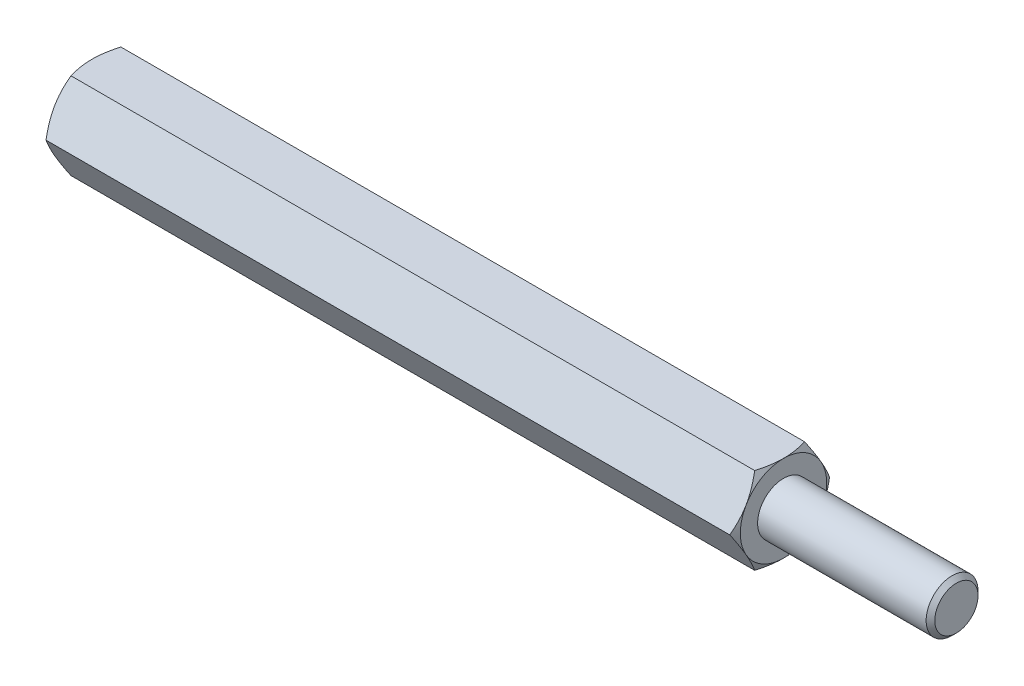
ISO-10303-21;
HEADER;
FILE_DESCRIPTION(('STEP AP214'),'2;1');
FILE_NAME('part.step','',(''),(''),'','','');
FILE_SCHEMA(('AUTOMOTIVE_DESIGN { 1 0 10303 214 1 1 1 1 }'));
ENDSEC;
DATA;
#1=APPLICATION_CONTEXT('core data for automotive mechanical design processes');
#2=APPLICATION_PROTOCOL_DEFINITION('international standard','automotive_design',2000,#1);
#3=PRODUCT_CONTEXT('',#1,'mechanical');
#4=PRODUCT('Part','Part','',(#3));
#5=PRODUCT_RELATED_PRODUCT_CATEGORY('part','',(#4));
#6=PRODUCT_DEFINITION_FORMATION('','',#4);
#7=PRODUCT_DEFINITION_CONTEXT('part definition',#1,'design');
#8=PRODUCT_DEFINITION('design','',#6,#7);
#9=PRODUCT_DEFINITION_SHAPE('','',#8);
#10=(LENGTH_UNIT() NAMED_UNIT(*) SI_UNIT(.MILLI.,.METRE.));
#11=(NAMED_UNIT(*) PLANE_ANGLE_UNIT() SI_UNIT($,.RADIAN.));
#12=(NAMED_UNIT(*) SI_UNIT($,.STERADIAN.) SOLID_ANGLE_UNIT());
#13=UNCERTAINTY_MEASURE_WITH_UNIT(LENGTH_MEASURE(1.E-05),#10,'distance_accuracy_value','');
#14=(GEOMETRIC_REPRESENTATION_CONTEXT(3) GLOBAL_UNCERTAINTY_ASSIGNED_CONTEXT((#13)) GLOBAL_UNIT_ASSIGNED_CONTEXT((#10,
#11,#12)) REPRESENTATION_CONTEXT('',''));
#15=CARTESIAN_POINT('',(0.,0.,0.));
#16=DIRECTION('',(0.,0.,1.));
#17=DIRECTION('',(1.,0.,0.));
#18=AXIS2_PLACEMENT_3D('',#15,#16,#17);
#19=CARTESIAN_POINT('',(20.,2.5,-1.44337567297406));
#20=DIRECTION('',(1.,0.,0.));
#21=DIRECTION('',(0.,0.,-1.));
#22=AXIS2_PLACEMENT_3D('',#19,#20,#21);
#23=PLANE('',#22);
#24=CARTESIAN_POINT('',(20.,0.,0.));
#25=DIRECTION('',(1.,0.,0.));
#26=DIRECTION('',(0.,0.,-1.));
#27=AXIS2_PLACEMENT_3D('',#24,#25,#26);
#28=CIRCLE('',#27,2.5);
#29=CARTESIAN_POINT('',(20.,-1.25,-2.1650635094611));
#30=VERTEX_POINT('',#29);
#31=CARTESIAN_POINT('',(20.,1.25,-2.1650635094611));
#32=VERTEX_POINT('',#31);
#33=EDGE_CURVE('E288',#30,#32,#28,.T.);
#34=ORIENTED_EDGE('',*,*,#33,.T.);
#35=CARTESIAN_POINT('',(20.,2.5,0.));
#36=VERTEX_POINT('',#35);
#37=EDGE_CURVE('E53',#32,#36,#28,.T.);
#38=ORIENTED_EDGE('',*,*,#37,.T.);
#39=CARTESIAN_POINT('',(20.,1.25,2.1650635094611));
#40=VERTEX_POINT('',#39);
#41=EDGE_CURVE('E297',#36,#40,#28,.T.);
#42=ORIENTED_EDGE('',*,*,#41,.T.);
#43=CARTESIAN_POINT('',(20.,-1.25000000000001,2.1650635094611));
#44=VERTEX_POINT('',#43);
#45=EDGE_CURVE('E301',#40,#44,#28,.T.);
#46=ORIENTED_EDGE('',*,*,#45,.T.);
#47=CARTESIAN_POINT('',(20.,0.,0.));
#48=DIRECTION('',(-1.,0.,0.));
#49=DIRECTION('',(0.,-1.,0.));
#50=AXIS2_PLACEMENT_3D('',#47,#48,#49);
#51=CIRCLE('',#50,2.5);
#52=CARTESIAN_POINT('',(20.,-2.50000000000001,0.));
#53=VERTEX_POINT('',#52);
#54=EDGE_CURVE('E193',#53,#44,#51,.T.);
#55=ORIENTED_EDGE('',*,*,#54,.F.);
#56=EDGE_CURVE('E61',#53,#30,#28,.T.);
#57=ORIENTED_EDGE('',*,*,#56,.T.);
#58=EDGE_LOOP('',(#34,#38,#42,#46,#55,#57));
#59=FACE_BOUND('',#58,.T.);
#60=CARTESIAN_POINT('',(20.,0.,0.));
#61=DIRECTION('',(1.,0.,0.));
#62=DIRECTION('',(0.,0.,-1.));
#63=AXIS2_PLACEMENT_3D('',#60,#61,#62);
#64=CIRCLE('',#63,1.5);
#65=CARTESIAN_POINT('',(20.,0.,-1.5));
#66=VERTEX_POINT('',#65);
#67=EDGE_CURVE('E409',#66,#66,#64,.T.);
#68=ORIENTED_EDGE('',*,*,#67,.F.);
#69=EDGE_LOOP('',(#68));
#70=FACE_BOUND('',#69,.T.);
#71=ADVANCED_FACE('F37',(#59,#70),#23,.T.);
#72=CARTESIAN_POINT('',(20.,0.,-2.88675134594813));
#73=DIRECTION('',(0.,-0.5,0.866025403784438));
#74=DIRECTION('',(0.,-0.866025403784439,-0.5));
#75=AXIS2_PLACEMENT_3D('',#72,#73,#74);
#76=PLANE('',#75);
#77=CARTESIAN_POINT('',(19.7766423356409,-0.000200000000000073,-2.88686681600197));
#78=CARTESIAN_POINT('',(19.8132783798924,0.109663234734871,-2.82343724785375));
#79=CARTESIAN_POINT('',(19.8465977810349,0.220474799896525,-2.75946016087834));
#80=CARTESIAN_POINT('',(19.9047577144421,0.444016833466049,-2.63039810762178));
#81=CARTESIAN_POINT('',(19.9295776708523,0.556751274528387,-2.5653108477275));
#82=CARTESIAN_POINT('',(19.968214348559,0.780822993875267,-2.43594298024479));
#83=CARTESIAN_POINT('',(19.9822882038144,0.892125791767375,-2.37168227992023));
#84=CARTESIAN_POINT('',(19.9990908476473,1.11525522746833,-2.24285844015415));
#85=CARTESIAN_POINT('',(20.0018335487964,1.22708105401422,-2.17829576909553));
#86=CARTESIAN_POINT('',(19.9961342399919,1.43604197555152,-2.05765212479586));
#87=CARTESIAN_POINT('',(19.9890916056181,1.53320831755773,-2.0015531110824));
#88=CARTESIAN_POINT('',(19.9667685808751,1.726907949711,-1.88972057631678));
#89=CARTESIAN_POINT('',(19.9514805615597,1.82344056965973,-1.8339874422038));
#90=CARTESIAN_POINT('',(19.9132609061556,2.01753972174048,-1.7219242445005));
#91=CARTESIAN_POINT('',(19.8901672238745,2.11508168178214,-1.66560836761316));
#92=CARTESIAN_POINT('',(19.8377533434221,2.30871060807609,-1.55381665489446));
#93=CARTESIAN_POINT('',(19.8084454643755,2.40480005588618,-1.49833938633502));
#94=CARTESIAN_POINT('',(19.7766423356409,2.5002,-1.44326020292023));
#95=B_SPLINE_CURVE_WITH_KNOTS('',3,(#77,#78,#79,#80,#81,#82,#83,#84,#85,#86,#87,#88,#89,#90,#91,
#92,#93,#94),.UNSPECIFIED.,.F.,.F.,(4,2,2,2,2,2,2,2,4),(0.,0.396285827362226,0.793524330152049,
1.18093086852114,1.56786160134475,1.90479741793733,2.24204551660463,2.58677531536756,
2.93082800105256),.UNSPECIFIED.);
#96=CARTESIAN_POINT('',(19.7767090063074,0.,-2.88675134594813));
#97=VERTEX_POINT('',#96);
#98=EDGE_CURVE('E312',#97,#32,#95,.T.);
#99=ORIENTED_EDGE('',*,*,#98,.F.);
#100=DIRECTION('',(-1.,0.,0.));
#101=VECTOR('',#100,1.);
#102=CARTESIAN_POINT('',(20.,0.,-2.88675134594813));
#103=LINE('',#102,#101);
#104=CARTESIAN_POINT('',(-19.7767090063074,0.,-2.88675134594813));
#105=VERTEX_POINT('',#104);
#106=EDGE_CURVE('E264',#97,#105,#103,.T.);
#107=ORIENTED_EDGE('',*,*,#106,.T.);
#108=CARTESIAN_POINT('',(-19.7766423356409,2.5002,-1.44326020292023));
#109=CARTESIAN_POINT('',(-19.8132783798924,2.39033676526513,-1.50668977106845));
#110=CARTESIAN_POINT('',(-19.8465977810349,2.27952520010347,-1.57066685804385));
#111=CARTESIAN_POINT('',(-19.9047577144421,2.05598316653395,-1.69972891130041));
#112=CARTESIAN_POINT('',(-19.9295776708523,1.94324872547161,-1.7648161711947));
#113=CARTESIAN_POINT('',(-19.968214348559,1.71917700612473,-1.8941840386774));
#114=CARTESIAN_POINT('',(-19.9822882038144,1.60787420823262,-1.95844473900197));
#115=CARTESIAN_POINT('',(-19.9990908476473,1.38474477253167,-2.08726857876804));
#116=CARTESIAN_POINT('',(-20.0018335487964,1.27291894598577,-2.15183124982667));
#117=CARTESIAN_POINT('',(-19.9961342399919,1.06395802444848,-2.27247489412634));
#118=CARTESIAN_POINT('',(-19.9890916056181,0.96679168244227,-2.32857390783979));
#119=CARTESIAN_POINT('',(-19.9667685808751,0.773092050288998,-2.44040644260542));
#120=CARTESIAN_POINT('',(-19.9514805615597,0.676559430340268,-2.49613957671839));
#121=CARTESIAN_POINT('',(-19.9132609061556,0.482460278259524,-2.60820277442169));
#122=CARTESIAN_POINT('',(-19.8901672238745,0.38491831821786,-2.66451865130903));
#123=CARTESIAN_POINT('',(-19.8377533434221,0.191289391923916,-2.77631036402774));
#124=CARTESIAN_POINT('',(-19.8084454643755,0.0951999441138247,-2.83178763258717));
#125=CARTESIAN_POINT('',(-19.7766423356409,-0.000199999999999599,-2.88686681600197));
#126=B_SPLINE_CURVE_WITH_KNOTS('',3,(#108,#109,#110,#111,#112,#113,#114,#115,#116,#117,#118,
#119,#120,#121,#122,#123,#124,#125),.UNSPECIFIED.,.F.,.F.,(4,2,2,2,2,2,2,2,4),(0.,
0.396285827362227,0.79352433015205,1.18093086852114,1.56786160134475,1.90479741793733,
2.24204551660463,2.58677531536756,2.93082800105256),.UNSPECIFIED.);
#127=CARTESIAN_POINT('',(-20.,1.25,-2.1650635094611));
#128=VERTEX_POINT('',#127);
#129=EDGE_CURVE('E378',#128,#105,#126,.T.);
#130=ORIENTED_EDGE('',*,*,#129,.F.);
#131=CARTESIAN_POINT('',(-19.7767090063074,2.5,-1.44337567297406));
#132=VERTEX_POINT('',#131);
#133=EDGE_CURVE('E376',#132,#128,#126,.T.);
#134=ORIENTED_EDGE('',*,*,#133,.F.);
#135=DIRECTION('',(-1.,0.,0.));
#136=VECTOR('',#135,1.);
#137=CARTESIAN_POINT('',(20.,2.5,-1.44337567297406));
#138=LINE('',#137,#136);
#139=CARTESIAN_POINT('',(19.7767090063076,2.5,-1.44337567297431));
#140=VERTEX_POINT('',#139);
#141=EDGE_CURVE('E279',#140,#132,#138,.T.);
#142=ORIENTED_EDGE('',*,*,#141,.F.);
#143=EDGE_CURVE('E229',#32,#140,#95,.T.);
#144=ORIENTED_EDGE('',*,*,#143,.F.);
#145=EDGE_LOOP('',(#99,#107,#130,#134,#142,#144));
#146=FACE_BOUND('',#145,.T.);
#147=ADVANCED_FACE('F148',(#146),#76,.F.);
#148=CARTESIAN_POINT('',(20.,2.5,-1.44337567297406));
#149=DIRECTION('',(0.,-1.,0.));
#150=DIRECTION('',(0.,0.,-1.));
#151=AXIS2_PLACEMENT_3D('',#148,#149,#150);
#152=PLANE('',#151);
#153=CARTESIAN_POINT('',(18.7680338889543,2.5,-3.90158441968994));
#154=CARTESIAN_POINT('',(18.8212077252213,2.5,-3.79217004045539));
#155=CARTESIAN_POINT('',(18.8738786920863,2.5,-3.68250707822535));
#156=CARTESIAN_POINT('',(18.9779324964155,2.5,-3.46255185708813));
#157=CARTESIAN_POINT('',(19.0293151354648,2.5,-3.35225950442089));
#158=CARTESIAN_POINT('',(19.1307630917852,2.5,-3.13035696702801));
#159=CARTESIAN_POINT('',(19.1808199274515,2.5,-3.0187428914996));
#160=CARTESIAN_POINT('',(19.2789171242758,2.5,-2.79463535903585));
#161=CARTESIAN_POINT('',(19.3269575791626,2.5,-2.68214194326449));
#162=CARTESIAN_POINT('',(19.4220184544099,2.5,-2.45240385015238));
#163=CARTESIAN_POINT('',(19.4689543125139,2.5,-2.33512399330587));
#164=CARTESIAN_POINT('',(19.5593326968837,2.5,-2.09920133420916));
#165=CARTESIAN_POINT('',(19.6027748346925,2.5,-1.98055838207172));
#166=CARTESIAN_POINT('',(19.6850435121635,2.5,-1.74193489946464));
#167=CARTESIAN_POINT('',(19.7238791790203,2.5,-1.6219575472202));
#168=CARTESIAN_POINT('',(19.7957050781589,2.5,-1.38028205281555));
#169=CARTESIAN_POINT('',(19.8286971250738,2.5,-1.25858445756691));
#170=CARTESIAN_POINT('',(19.8870959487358,2.5,-1.01406369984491));
#171=CARTESIAN_POINT('',(19.9125437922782,2.5,-0.891250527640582));
#172=CARTESIAN_POINT('',(19.9544275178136,2.5,-0.644071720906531));
#173=CARTESIAN_POINT('',(19.9708643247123,2.5,-0.519706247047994));
#174=CARTESIAN_POINT('',(19.9932006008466,2.5,-0.271679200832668));
#175=CARTESIAN_POINT('',(19.9992375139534,2.5,-0.148030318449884));
#176=CARTESIAN_POINT('',(20.0006256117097,2.5,0.0993395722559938));
#177=CARTESIAN_POINT('',(19.9959765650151,2.5,0.223060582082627));
#178=CARTESIAN_POINT('',(19.9794044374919,2.5,0.432351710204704));
#179=CARTESIAN_POINT('',(19.9701066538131,2.5,0.518143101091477));
#180=CARTESIAN_POINT('',(19.9469384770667,2.5,0.689112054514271));
#181=CARTESIAN_POINT('',(19.9330674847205,2.5,0.774289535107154));
#182=CARTESIAN_POINT('',(19.8853202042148,2.5,1.02876599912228));
#183=CARTESIAN_POINT('',(19.8453176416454,2.5,1.19691958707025));
#184=CARTESIAN_POINT('',(19.7522656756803,2.5,1.53362893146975));
#185=CARTESIAN_POINT('',(19.6989362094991,2.5,1.70210423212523));
#186=CARTESIAN_POINT('',(19.6123716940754,2.5,1.95247339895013));
#187=CARTESIAN_POINT('',(19.5824247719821,2.5,2.0355318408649));
#188=CARTESIAN_POINT('',(19.5206840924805,2.5,2.20095860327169));
#189=CARTESIAN_POINT('',(19.4888903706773,2.5,2.28332693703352));
#190=CARTESIAN_POINT('',(19.404014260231,2.5,2.49723312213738));
#191=CARTESIAN_POINT('',(19.3497173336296,2.5,2.62828796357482));
#192=CARTESIAN_POINT('',(19.2381273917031,2.5,2.88912034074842));
#193=CARTESIAN_POINT('',(19.1808341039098,2.5,3.01889775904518));
#194=CARTESIAN_POINT('',(19.0639348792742,2.5,3.27745045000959));
#195=CARTESIAN_POINT('',(19.004328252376,2.5,3.40622540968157));
#196=CARTESIAN_POINT('',(18.8833234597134,2.5,3.66293235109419));
#197=CARTESIAN_POINT('',(18.821925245,2.5,3.7908643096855));
#198=CARTESIAN_POINT('',(18.6354580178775,2.5,4.17399495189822));
#199=CARTESIAN_POINT('',(18.5082824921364,2.5,4.42816724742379));
#200=CARTESIAN_POINT('',(18.2503455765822,2.5,4.9346146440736));
#201=CARTESIAN_POINT('',(18.1195848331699,2.5,5.1868900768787));
#202=CARTESIAN_POINT('',(17.8687100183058,2.5,5.66512451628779));
#203=CARTESIAN_POINT('',(17.7488298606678,2.5,5.89120644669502));
#204=CARTESIAN_POINT('',(17.5075902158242,2.5,6.34259369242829));
#205=CARTESIAN_POINT('',(17.3862306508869,2.5,6.56789896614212));
#206=CARTESIAN_POINT('',(17.142780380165,2.5,7.01722044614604));
#207=CARTESIAN_POINT('',(17.0206930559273,2.5,7.24123848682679));
#208=CARTESIAN_POINT('',(16.7756662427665,2.5,7.68878772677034));
#209=CARTESIAN_POINT('',(16.652726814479,2.5,7.91231895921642));
#210=CARTESIAN_POINT('',(16.5294756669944,2.5,8.1356769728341));
#211=B_SPLINE_CURVE_WITH_KNOTS('',3,(#153,#154,#155,#156,#157,#158,#159,#160,#161,#162,#163,
#164,#165,#166,#167,#168,#169,#170,#171,#172,#173,#174,#175,#176,#177,#178,#179,#180,#181,#182,
#183,#184,#185,#186,#187,#188,#189,#190,#191,#192,#193,#194,#195,#196,#197,#198,#199,#200,#201,
#202,#203,#204,#205,#206,#207,#208,#209,#210),.UNSPECIFIED.,.F.,.F.,(4,2,2,2,2,2,2,2,2,2,2,2,2,
2,2,2,2,2,2,2,2,2,2,2,2,2,2,2,4),(0.,0.364957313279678,0.729970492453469,1.09692930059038,
1.46387103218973,1.84279746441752,2.22176597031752,2.59997058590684,2.97805755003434,
3.35404692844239,3.72999770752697,4.10094071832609,4.47189175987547,4.73064905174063,
4.98944026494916,5.50729076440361,6.03710483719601,6.30196454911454,6.56681915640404,
6.99233818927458,7.41789598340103,7.84358170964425,8.26927907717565,9.12186602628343,
9.97430025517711,10.7419897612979,11.5097197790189,12.2750964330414,13.0404191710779),.UNSPECIFIED.);
#212=EDGE_CURVE('E227',#140,#36,#211,.T.);
#213=ORIENTED_EDGE('',*,*,#212,.F.);
#214=ORIENTED_EDGE('',*,*,#141,.T.);
#215=CARTESIAN_POINT('',(-18.7680338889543,2.5,-3.90158441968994));
#216=CARTESIAN_POINT('',(-18.8212077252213,2.5,-3.79217004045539));
#217=CARTESIAN_POINT('',(-18.8738786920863,2.5,-3.68250707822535));
#218=CARTESIAN_POINT('',(-18.9779324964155,2.5,-3.46255185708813));
#219=CARTESIAN_POINT('',(-19.0293151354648,2.5,-3.35225950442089));
#220=CARTESIAN_POINT('',(-19.1307630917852,2.5,-3.13035696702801));
#221=CARTESIAN_POINT('',(-19.1808199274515,2.5,-3.0187428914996));
#222=CARTESIAN_POINT('',(-19.2789171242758,2.5,-2.79463535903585));
#223=CARTESIAN_POINT('',(-19.3269575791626,2.5,-2.68214194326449));
#224=CARTESIAN_POINT('',(-19.4220184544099,2.5,-2.45240385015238));
#225=CARTESIAN_POINT('',(-19.4689543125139,2.5,-2.33512399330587));
#226=CARTESIAN_POINT('',(-19.5593326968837,2.5,-2.09920133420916));
#227=CARTESIAN_POINT('',(-19.6027748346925,2.5,-1.98055838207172));
#228=CARTESIAN_POINT('',(-19.6850435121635,2.5,-1.74193489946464));
#229=CARTESIAN_POINT('',(-19.7238791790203,2.5,-1.6219575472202));
#230=CARTESIAN_POINT('',(-19.7957050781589,2.5,-1.38028205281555));
#231=CARTESIAN_POINT('',(-19.8286971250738,2.5,-1.25858445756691));
#232=CARTESIAN_POINT('',(-19.8870959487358,2.5,-1.01406369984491));
#233=CARTESIAN_POINT('',(-19.9125437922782,2.5,-0.891250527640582));
#234=CARTESIAN_POINT('',(-19.9544275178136,2.5,-0.644071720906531));
#235=CARTESIAN_POINT('',(-19.9708643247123,2.5,-0.519706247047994));
#236=CARTESIAN_POINT('',(-19.9932006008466,2.5,-0.271679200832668));
#237=CARTESIAN_POINT('',(-19.9992375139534,2.5,-0.148030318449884));
#238=CARTESIAN_POINT('',(-20.0006256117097,2.5,0.0993395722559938));
#239=CARTESIAN_POINT('',(-19.9959765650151,2.5,0.223060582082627));
#240=CARTESIAN_POINT('',(-19.9794044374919,2.5,0.432351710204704));
#241=CARTESIAN_POINT('',(-19.9701066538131,2.5,0.518143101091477));
#242=CARTESIAN_POINT('',(-19.9469384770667,2.5,0.689112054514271));
#243=CARTESIAN_POINT('',(-19.9330674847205,2.5,0.774289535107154));
#244=CARTESIAN_POINT('',(-19.8853202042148,2.5,1.02876599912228));
#245=CARTESIAN_POINT('',(-19.8453176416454,2.5,1.19691958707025));
#246=CARTESIAN_POINT('',(-19.7522656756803,2.5,1.53362893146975));
#247=CARTESIAN_POINT('',(-19.6989362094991,2.5,1.70210423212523));
#248=CARTESIAN_POINT('',(-19.6123716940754,2.5,1.95247339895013));
#249=CARTESIAN_POINT('',(-19.5824247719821,2.5,2.0355318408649));
#250=CARTESIAN_POINT('',(-19.5206840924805,2.5,2.20095860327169));
#251=CARTESIAN_POINT('',(-19.4888903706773,2.5,2.28332693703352));
#252=CARTESIAN_POINT('',(-19.404014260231,2.5,2.49723312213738));
#253=CARTESIAN_POINT('',(-19.3497173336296,2.5,2.62828796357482));
#254=CARTESIAN_POINT('',(-19.2381273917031,2.5,2.88912034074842));
#255=CARTESIAN_POINT('',(-19.1808341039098,2.5,3.01889775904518));
#256=CARTESIAN_POINT('',(-19.0639348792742,2.5,3.27745045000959));
#257=CARTESIAN_POINT('',(-19.004328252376,2.5,3.40622540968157));
#258=CARTESIAN_POINT('',(-18.8833234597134,2.5,3.66293235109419));
#259=CARTESIAN_POINT('',(-18.821925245,2.5,3.7908643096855));
#260=CARTESIAN_POINT('',(-18.6354580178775,2.5,4.17399495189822));
#261=CARTESIAN_POINT('',(-18.5082824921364,2.5,4.42816724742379));
#262=CARTESIAN_POINT('',(-18.2503455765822,2.5,4.9346146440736));
#263=CARTESIAN_POINT('',(-18.1195848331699,2.5,5.1868900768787));
#264=CARTESIAN_POINT('',(-17.8687100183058,2.5,5.66512451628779));
#265=CARTESIAN_POINT('',(-17.7488298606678,2.5,5.89120644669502));
#266=CARTESIAN_POINT('',(-17.5075902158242,2.5,6.34259369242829));
#267=CARTESIAN_POINT('',(-17.3862306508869,2.5,6.56789896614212));
#268=CARTESIAN_POINT('',(-17.142780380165,2.5,7.01722044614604));
#269=CARTESIAN_POINT('',(-17.0206930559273,2.5,7.24123848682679));
#270=CARTESIAN_POINT('',(-16.7756662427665,2.5,7.68878772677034));
#271=CARTESIAN_POINT('',(-16.652726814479,2.5,7.91231895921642));
#272=CARTESIAN_POINT('',(-16.5294756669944,2.5,8.1356769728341));
#273=B_SPLINE_CURVE_WITH_KNOTS('',3,(#215,#216,#217,#218,#219,#220,#221,#222,#223,#224,#225,
#226,#227,#228,#229,#230,#231,#232,#233,#234,#235,#236,#237,#238,#239,#240,#241,#242,#243,#244,
#245,#246,#247,#248,#249,#250,#251,#252,#253,#254,#255,#256,#257,#258,#259,#260,#261,#262,#263,
#264,#265,#266,#267,#268,#269,#270,#271,#272),.UNSPECIFIED.,.F.,.F.,(4,2,2,2,2,2,2,2,2,2,2,2,2,
2,2,2,2,2,2,2,2,2,2,2,2,2,2,2,4),(0.,0.364957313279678,0.729970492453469,1.09692930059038,
1.46387103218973,1.84279746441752,2.22176597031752,2.59997058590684,2.97805755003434,
3.35404692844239,3.72999770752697,4.10094071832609,4.47189175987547,4.73064905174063,
4.98944026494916,5.50729076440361,6.03710483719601,6.30196454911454,6.56681915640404,
6.99233818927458,7.41789598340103,7.84358170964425,8.26927907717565,9.12186602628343,
9.97430025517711,10.7419897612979,11.5097197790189,12.2750964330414,13.0404191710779),.UNSPECIFIED.);
#274=CARTESIAN_POINT('',(-20.,2.5,0.));
#275=VERTEX_POINT('',#274);
#276=EDGE_CURVE('E241',#275,#132,#273,.F.);
#277=ORIENTED_EDGE('',*,*,#276,.F.);
#278=CARTESIAN_POINT('',(-19.7767090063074,2.5,1.44337567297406));
#279=VERTEX_POINT('',#278);
#280=EDGE_CURVE('E249',#279,#275,#273,.F.);
#281=ORIENTED_EDGE('',*,*,#280,.F.);
#282=DIRECTION('',(-1.,0.,0.));
#283=VECTOR('',#282,1.);
#284=CARTESIAN_POINT('',(20.,2.5,1.44337567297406));
#285=LINE('',#284,#283);
#286=CARTESIAN_POINT('',(19.7767090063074,2.5,1.44337567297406));
#287=VERTEX_POINT('',#286);
#288=EDGE_CURVE('E276',#287,#279,#285,.T.);
#289=ORIENTED_EDGE('',*,*,#288,.F.);
#290=EDGE_CURVE('E221',#36,#287,#211,.T.);
#291=ORIENTED_EDGE('',*,*,#290,.F.);
#292=EDGE_LOOP('',(#213,#214,#277,#281,#289,#291));
#293=FACE_BOUND('',#292,.T.);
#294=ADVANCED_FACE('F153',(#293),#152,.F.);
#295=CARTESIAN_POINT('',(20.,2.5,1.44337567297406));
#296=DIRECTION('',(0.,-0.5,-0.866025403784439));
#297=DIRECTION('',(0.,0.866025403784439,-0.5));
#298=AXIS2_PLACEMENT_3D('',#295,#296,#297);
#299=PLANE('',#298);
#300=CARTESIAN_POINT('',(19.7766423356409,2.5002,1.44326020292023));
#301=CARTESIAN_POINT('',(19.8132783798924,2.39033676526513,1.50668977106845));
#302=CARTESIAN_POINT('',(19.8465977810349,2.27952520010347,1.57066685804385));
#303=CARTESIAN_POINT('',(19.9047577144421,2.05598316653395,1.69972891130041));
#304=CARTESIAN_POINT('',(19.9295776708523,1.94324872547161,1.7648161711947));
#305=CARTESIAN_POINT('',(19.9682143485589,1.71917700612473,1.8941840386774));
#306=CARTESIAN_POINT('',(19.9822882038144,1.60787420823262,1.95844473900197));
#307=CARTESIAN_POINT('',(19.9990908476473,1.38474477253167,2.08726857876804));
#308=CARTESIAN_POINT('',(20.0018335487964,1.27291894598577,2.15183124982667));
#309=CARTESIAN_POINT('',(19.9961342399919,1.06395802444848,2.27247489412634));
#310=CARTESIAN_POINT('',(19.9890916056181,0.96679168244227,2.32857390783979));
#311=CARTESIAN_POINT('',(19.9667685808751,0.773092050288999,2.44040644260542));
#312=CARTESIAN_POINT('',(19.9514805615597,0.676559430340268,2.49613957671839));
#313=CARTESIAN_POINT('',(19.9132609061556,0.482460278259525,2.60820277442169));
#314=CARTESIAN_POINT('',(19.8901672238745,0.38491831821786,2.66451865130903));
#315=CARTESIAN_POINT('',(19.8377533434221,0.191289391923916,2.77631036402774));
#316=CARTESIAN_POINT('',(19.8084454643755,0.0951999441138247,2.83178763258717));
#317=CARTESIAN_POINT('',(19.7766423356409,-0.000199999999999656,2.88686681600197));
#318=B_SPLINE_CURVE_WITH_KNOTS('',3,(#300,#301,#302,#303,#304,#305,#306,#307,#308,#309,#310,
#311,#312,#313,#314,#315,#316,#317),.UNSPECIFIED.,.F.,.F.,(4,2,2,2,2,2,2,2,4),(0.,
0.396285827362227,0.793524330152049,1.18093086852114,1.56786160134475,1.90479741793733,
2.24204551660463,2.58677531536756,2.93082800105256),.UNSPECIFIED.);
#319=EDGE_CURVE('E228',#287,#40,#318,.T.);
#320=ORIENTED_EDGE('',*,*,#319,.F.);
#321=ORIENTED_EDGE('',*,*,#288,.T.);
#322=CARTESIAN_POINT('',(-19.7766423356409,-0.000199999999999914,2.88686681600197));
#323=CARTESIAN_POINT('',(-19.8132783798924,0.109663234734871,2.82343724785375));
#324=CARTESIAN_POINT('',(-19.8465977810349,0.220474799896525,2.75946016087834));
#325=CARTESIAN_POINT('',(-19.9047577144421,0.444016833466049,2.63039810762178));
#326=CARTESIAN_POINT('',(-19.9295776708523,0.556751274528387,2.5653108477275));
#327=CARTESIAN_POINT('',(-19.968214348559,0.780822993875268,2.43594298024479));
#328=CARTESIAN_POINT('',(-19.9822882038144,0.892125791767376,2.37168227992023));
#329=CARTESIAN_POINT('',(-19.9990908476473,1.11525522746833,2.24285844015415));
#330=CARTESIAN_POINT('',(-20.0018335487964,1.22708105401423,2.17829576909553));
#331=CARTESIAN_POINT('',(-19.9961342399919,1.43604197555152,2.05765212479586));
#332=CARTESIAN_POINT('',(-19.9890916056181,1.53320831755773,2.0015531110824));
#333=CARTESIAN_POINT('',(-19.9667685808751,1.726907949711,1.88972057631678));
#334=CARTESIAN_POINT('',(-19.9514805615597,1.82344056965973,1.8339874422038));
#335=CARTESIAN_POINT('',(-19.9132609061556,2.01753972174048,1.7219242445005));
#336=CARTESIAN_POINT('',(-19.8901672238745,2.11508168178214,1.66560836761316));
#337=CARTESIAN_POINT('',(-19.8377533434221,2.30871060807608,1.55381665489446));
#338=CARTESIAN_POINT('',(-19.8084454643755,2.40480005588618,1.49833938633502));
#339=CARTESIAN_POINT('',(-19.7766423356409,2.5002,1.44326020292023));
#340=B_SPLINE_CURVE_WITH_KNOTS('',3,(#322,#323,#324,#325,#326,#327,#328,#329,#330,#331,#332,
#333,#334,#335,#336,#337,#338,#339),.UNSPECIFIED.,.F.,.F.,(4,2,2,2,2,2,2,2,4),(0.,
0.396285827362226,0.793524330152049,1.18093086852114,1.56786160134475,1.90479741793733,
2.24204551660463,2.58677531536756,2.93082800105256),.UNSPECIFIED.);
#341=CARTESIAN_POINT('',(-20.,1.25,2.1650635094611));
#342=VERTEX_POINT('',#341);
#343=EDGE_CURVE('E255',#342,#279,#340,.T.);
#344=ORIENTED_EDGE('',*,*,#343,.F.);
#345=CARTESIAN_POINT('',(-19.7767090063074,0.,2.88675134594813));
#346=VERTEX_POINT('',#345);
#347=EDGE_CURVE('E262',#346,#342,#340,.T.);
#348=ORIENTED_EDGE('',*,*,#347,.F.);
#349=DIRECTION('',(-1.,0.,0.));
#350=VECTOR('',#349,1.);
#351=CARTESIAN_POINT('',(20.,0.,2.88675134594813));
#352=LINE('',#351,#350);
#353=CARTESIAN_POINT('',(19.7767090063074,0.,2.88675134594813));
#354=VERTEX_POINT('',#353);
#355=EDGE_CURVE('E273',#354,#346,#352,.T.);
#356=ORIENTED_EDGE('',*,*,#355,.F.);
#357=EDGE_CURVE('E215',#40,#354,#318,.T.);
#358=ORIENTED_EDGE('',*,*,#357,.F.);
#359=EDGE_LOOP('',(#320,#321,#344,#348,#356,#358));
#360=FACE_BOUND('',#359,.T.);
#361=ADVANCED_FACE('F235',(#360),#299,.F.);
#362=CARTESIAN_POINT('',(20.,0.,2.88675134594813));
#363=DIRECTION('',(0.,0.5,-0.866025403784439));
#364=DIRECTION('',(0.,0.866025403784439,0.5));
#365=AXIS2_PLACEMENT_3D('',#362,#363,#364);
#366=PLANE('',#365);
#367=CARTESIAN_POINT('',(19.7766423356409,0.00020000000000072,2.88686681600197));
#368=CARTESIAN_POINT('',(19.8132783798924,-0.10966323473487,2.82343724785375));
#369=CARTESIAN_POINT('',(19.8465977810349,-0.220474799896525,2.75946016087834));
#370=CARTESIAN_POINT('',(19.9047577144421,-0.444016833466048,2.63039810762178));
#371=CARTESIAN_POINT('',(19.9295776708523,-0.556751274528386,2.5653108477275));
#372=CARTESIAN_POINT('',(19.968214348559,-0.780822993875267,2.43594298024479));
#373=CARTESIAN_POINT('',(19.9822882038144,-0.892125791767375,2.37168227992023));
#374=CARTESIAN_POINT('',(19.9990908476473,-1.11525522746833,2.24285844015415));
#375=CARTESIAN_POINT('',(20.0018335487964,-1.22708105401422,2.17829576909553));
#376=CARTESIAN_POINT('',(19.9961342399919,-1.43604197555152,2.05765212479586));
#377=CARTESIAN_POINT('',(19.9890916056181,-1.53320831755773,2.0015531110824));
#378=CARTESIAN_POINT('',(19.9667685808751,-1.726907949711,1.88972057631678));
#379=CARTESIAN_POINT('',(19.9514805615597,-1.82344056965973,1.8339874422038));
#380=CARTESIAN_POINT('',(19.9132609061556,-2.01753972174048,1.7219242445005));
#381=CARTESIAN_POINT('',(19.8901672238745,-2.11508168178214,1.66560836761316));
#382=CARTESIAN_POINT('',(19.8377533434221,-2.30871060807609,1.55381665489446));
#383=CARTESIAN_POINT('',(19.8084454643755,-2.40480005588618,1.49833938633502));
#384=CARTESIAN_POINT('',(19.7766423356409,-2.5002,1.44326020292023));
#385=B_SPLINE_CURVE_WITH_KNOTS('',3,(#367,#368,#369,#370,#371,#372,#373,#374,#375,#376,#377,
#378,#379,#380,#381,#382,#383,#384),.UNSPECIFIED.,.F.,.F.,(4,2,2,2,2,2,2,2,4),(0.,
0.396285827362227,0.793524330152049,1.18093086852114,1.56786160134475,1.90479741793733,
2.24204551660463,2.58677531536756,2.93082800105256),.UNSPECIFIED.);
#386=EDGE_CURVE('E398',#354,#44,#385,.T.);
#387=ORIENTED_EDGE('',*,*,#386,.F.);
#388=ORIENTED_EDGE('',*,*,#355,.T.);
#389=CARTESIAN_POINT('',(-19.7766423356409,-2.5002,1.44326020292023));
#390=CARTESIAN_POINT('',(-19.8132783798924,-2.39033676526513,1.50668977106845));
#391=CARTESIAN_POINT('',(-19.8465977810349,-2.27952520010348,1.57066685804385));
#392=CARTESIAN_POINT('',(-19.9047577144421,-2.05598316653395,1.69972891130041));
#393=CARTESIAN_POINT('',(-19.9295776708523,-1.94324872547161,1.76481617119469));
#394=CARTESIAN_POINT('',(-19.968214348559,-1.71917700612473,1.8941840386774));
#395=CARTESIAN_POINT('',(-19.9822882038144,-1.60787420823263,1.95844473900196));
#396=CARTESIAN_POINT('',(-19.9990908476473,-1.38474477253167,2.08726857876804));
#397=CARTESIAN_POINT('',(-20.0018335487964,-1.27291894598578,2.15183124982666));
#398=CARTESIAN_POINT('',(-19.9961342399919,-1.06395802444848,2.27247489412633));
#399=CARTESIAN_POINT('',(-19.9890916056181,-0.966791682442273,2.32857390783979));
#400=CARTESIAN_POINT('',(-19.9667685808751,-0.773092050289,2.44040644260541));
#401=CARTESIAN_POINT('',(-19.9514805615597,-0.67655943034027,2.49613957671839));
#402=CARTESIAN_POINT('',(-19.9132609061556,-0.482460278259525,2.60820277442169));
#403=CARTESIAN_POINT('',(-19.8901672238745,-0.38491831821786,2.66451865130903));
#404=CARTESIAN_POINT('',(-19.8377533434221,-0.191289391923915,2.77631036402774));
#405=CARTESIAN_POINT('',(-19.8084454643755,-0.0951999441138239,2.83178763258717));
#406=CARTESIAN_POINT('',(-19.7766423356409,0.000200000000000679,2.88686681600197));
#407=B_SPLINE_CURVE_WITH_KNOTS('',3,(#389,#390,#391,#392,#393,#394,#395,#396,#397,#398,#399,
#400,#401,#402,#403,#404,#405,#406),.UNSPECIFIED.,.F.,.F.,(4,2,2,2,2,2,2,2,4),(0.,
0.396285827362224,0.793524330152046,1.18093086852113,1.56786160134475,1.90479741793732,
2.24204551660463,2.58677531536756,2.93082800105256),.UNSPECIFIED.);
#408=CARTESIAN_POINT('',(-20.,-1.25000000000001,2.1650635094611));
#409=VERTEX_POINT('',#408);
#410=EDGE_CURVE('E263',#409,#346,#407,.T.);
#411=ORIENTED_EDGE('',*,*,#410,.F.);
#412=CARTESIAN_POINT('',(-19.7767090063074,-2.5,1.44337567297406));
#413=VERTEX_POINT('',#412);
#414=EDGE_CURVE('E250',#413,#409,#407,.T.);
#415=ORIENTED_EDGE('',*,*,#414,.F.);
#416=DIRECTION('',(-1.,0.,0.));
#417=VECTOR('',#416,1.);
#418=CARTESIAN_POINT('',(20.,-2.5,1.44337567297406));
#419=LINE('',#418,#417);
#420=CARTESIAN_POINT('',(19.7767090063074,-2.5,1.44337567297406));
#421=VERTEX_POINT('',#420);
#422=EDGE_CURVE('E270',#421,#413,#419,.T.);
#423=ORIENTED_EDGE('',*,*,#422,.F.);
#424=EDGE_CURVE('E210',#44,#421,#385,.T.);
#425=ORIENTED_EDGE('',*,*,#424,.F.);
#426=EDGE_LOOP('',(#387,#388,#411,#415,#423,#425));
#427=FACE_BOUND('',#426,.T.);
#428=ADVANCED_FACE('F366',(#427),#366,.F.);
#429=CARTESIAN_POINT('',(20.,-2.5,1.44337567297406));
#430=DIRECTION('',(0.,1.,0.));
#431=DIRECTION('',(0.,0.,1.));
#432=AXIS2_PLACEMENT_3D('',#429,#430,#431);
#433=PLANE('',#432);
#434=CARTESIAN_POINT('',(18.7680338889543,-2.5,-3.90158441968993));
#435=CARTESIAN_POINT('',(18.8212077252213,-2.5,-3.79217004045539));
#436=CARTESIAN_POINT('',(18.8738786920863,-2.5,-3.68250707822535));
#437=CARTESIAN_POINT('',(18.9779324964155,-2.5,-3.46255185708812));
#438=CARTESIAN_POINT('',(19.0293151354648,-2.5,-3.35225950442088));
#439=CARTESIAN_POINT('',(19.1307630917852,-2.5,-3.130356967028));
#440=CARTESIAN_POINT('',(19.1808199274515,-2.5,-3.0187428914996));
#441=CARTESIAN_POINT('',(19.2789171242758,-2.5,-2.79463535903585));
#442=CARTESIAN_POINT('',(19.3269575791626,-2.5,-2.68214194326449));
#443=CARTESIAN_POINT('',(19.4220184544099,-2.5,-2.45240385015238));
#444=CARTESIAN_POINT('',(19.4689543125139,-2.5,-2.33512399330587));
#445=CARTESIAN_POINT('',(19.5593326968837,-2.5,-2.09920133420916));
#446=CARTESIAN_POINT('',(19.6027748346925,-2.5,-1.98055838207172));
#447=CARTESIAN_POINT('',(19.6850435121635,-2.5,-1.74193489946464));
#448=CARTESIAN_POINT('',(19.7238791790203,-2.5,-1.6219575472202));
#449=CARTESIAN_POINT('',(19.7957050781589,-2.5,-1.38028205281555));
#450=CARTESIAN_POINT('',(19.8286971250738,-2.5,-1.25858445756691));
#451=CARTESIAN_POINT('',(19.8870959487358,-2.5,-1.01406369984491));
#452=CARTESIAN_POINT('',(19.9125437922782,-2.5,-0.891250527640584));
#453=CARTESIAN_POINT('',(19.9544275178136,-2.5,-0.644071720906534));
#454=CARTESIAN_POINT('',(19.9708643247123,-2.5,-0.519706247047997));
#455=CARTESIAN_POINT('',(19.9932006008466,-2.5,-0.271679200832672));
#456=CARTESIAN_POINT('',(19.9992375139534,-2.5,-0.148030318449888));
#457=CARTESIAN_POINT('',(20.0006256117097,-2.5,0.0993395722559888));
#458=CARTESIAN_POINT('',(19.9959765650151,-2.5,0.223060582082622));
#459=CARTESIAN_POINT('',(19.9794044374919,-2.5,0.432351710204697));
#460=CARTESIAN_POINT('',(19.9701066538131,-2.5,0.51814310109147));
#461=CARTESIAN_POINT('',(19.9469384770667,-2.5,0.689112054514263));
#462=CARTESIAN_POINT('',(19.9330674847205,-2.5,0.774289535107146));
#463=CARTESIAN_POINT('',(19.8853202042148,-2.5,1.02876599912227));
#464=CARTESIAN_POINT('',(19.8453176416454,-2.5,1.19691958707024));
#465=CARTESIAN_POINT('',(19.7522656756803,-2.5,1.53362893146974));
#466=CARTESIAN_POINT('',(19.6989362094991,-2.5,1.70210423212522));
#467=CARTESIAN_POINT('',(19.6123716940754,-2.5,1.95247339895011));
#468=CARTESIAN_POINT('',(19.5824247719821,-2.5,2.03553184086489));
#469=CARTESIAN_POINT('',(19.5206840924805,-2.5,2.20095860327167));
#470=CARTESIAN_POINT('',(19.4888903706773,-2.5,2.2833269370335));
#471=CARTESIAN_POINT('',(19.404014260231,-2.5,2.49723312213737));
#472=CARTESIAN_POINT('',(19.3497173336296,-2.5,2.62828796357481));
#473=CARTESIAN_POINT('',(19.2381273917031,-2.5,2.88912034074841));
#474=CARTESIAN_POINT('',(19.1808341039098,-2.5,3.01889775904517));
#475=CARTESIAN_POINT('',(19.0639348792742,-2.5,3.27745045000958));
#476=CARTESIAN_POINT('',(19.004328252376,-2.5,3.40622540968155));
#477=CARTESIAN_POINT('',(18.8833234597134,-2.5,3.66293235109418));
#478=CARTESIAN_POINT('',(18.821925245,-2.5,3.79086430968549));
#479=CARTESIAN_POINT('',(18.6354580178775,-2.5,4.17399495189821));
#480=CARTESIAN_POINT('',(18.5082824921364,-2.5,4.42816724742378));
#481=CARTESIAN_POINT('',(18.2503455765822,-2.5,4.93461464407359));
#482=CARTESIAN_POINT('',(18.1195848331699,-2.5,5.18689007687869));
#483=CARTESIAN_POINT('',(17.8687100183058,-2.5,5.66512451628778));
#484=CARTESIAN_POINT('',(17.7488298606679,-2.5,5.89120644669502));
#485=CARTESIAN_POINT('',(17.5075902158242,-2.5,6.34259369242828));
#486=CARTESIAN_POINT('',(17.3862306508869,-2.5,6.56789896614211));
#487=CARTESIAN_POINT('',(17.142780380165,-2.5,7.01722044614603));
#488=CARTESIAN_POINT('',(17.0206930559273,-2.5,7.24123848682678));
#489=CARTESIAN_POINT('',(16.7756662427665,-2.5,7.68878772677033));
#490=CARTESIAN_POINT('',(16.652726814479,-2.5,7.91231895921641));
#491=CARTESIAN_POINT('',(16.5294756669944,-2.5,8.13567697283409));
#492=B_SPLINE_CURVE_WITH_KNOTS('',3,(#434,#435,#436,#437,#438,#439,#440,#441,#442,#443,#444,
#445,#446,#447,#448,#449,#450,#451,#452,#453,#454,#455,#456,#457,#458,#459,#460,#461,#462,#463,
#464,#465,#466,#467,#468,#469,#470,#471,#472,#473,#474,#475,#476,#477,#478,#479,#480,#481,#482,
#483,#484,#485,#486,#487,#488,#489,#490,#491),.UNSPECIFIED.,.F.,.F.,(4,2,2,2,2,2,2,2,2,2,2,2,2,
2,2,2,2,2,2,2,2,2,2,2,2,2,2,2,4),(0.,0.364957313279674,0.729970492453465,1.09692930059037,
1.46387103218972,1.84279746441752,2.22176597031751,2.59997058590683,2.97805755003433,
3.35404692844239,3.72999770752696,4.10094071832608,4.47189175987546,4.73064905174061,
4.98944026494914,5.50729076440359,6.03710483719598,6.30196454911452,6.56681915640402,
6.99233818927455,7.41789598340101,7.84358170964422,8.26927907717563,9.12186602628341,
9.97430025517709,10.7419897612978,11.5097197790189,12.2750964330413,13.0404191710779),.UNSPECIFIED.);
#493=EDGE_CURVE('E316',#421,#53,#492,.F.);
#494=ORIENTED_EDGE('',*,*,#493,.F.);
#495=ORIENTED_EDGE('',*,*,#422,.T.);
#496=CARTESIAN_POINT('',(-18.7680338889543,-2.5,-3.90158441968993));
#497=CARTESIAN_POINT('',(-18.8212077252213,-2.5,-3.79217004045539));
#498=CARTESIAN_POINT('',(-18.8738786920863,-2.5,-3.68250707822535));
#499=CARTESIAN_POINT('',(-18.9779324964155,-2.5,-3.46255185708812));
#500=CARTESIAN_POINT('',(-19.0293151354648,-2.5,-3.35225950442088));
#501=CARTESIAN_POINT('',(-19.1307630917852,-2.5,-3.130356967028));
#502=CARTESIAN_POINT('',(-19.1808199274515,-2.5,-3.0187428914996));
#503=CARTESIAN_POINT('',(-19.2789171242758,-2.5,-2.79463535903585));
#504=CARTESIAN_POINT('',(-19.3269575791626,-2.5,-2.68214194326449));
#505=CARTESIAN_POINT('',(-19.4220184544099,-2.5,-2.45240385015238));
#506=CARTESIAN_POINT('',(-19.4689543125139,-2.5,-2.33512399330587));
#507=CARTESIAN_POINT('',(-19.5593326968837,-2.5,-2.09920133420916));
#508=CARTESIAN_POINT('',(-19.6027748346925,-2.5,-1.98055838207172));
#509=CARTESIAN_POINT('',(-19.6850435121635,-2.5,-1.74193489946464));
#510=CARTESIAN_POINT('',(-19.7238791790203,-2.5,-1.6219575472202));
#511=CARTESIAN_POINT('',(-19.7957050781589,-2.5,-1.38028205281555));
#512=CARTESIAN_POINT('',(-19.8286971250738,-2.5,-1.25858445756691));
#513=CARTESIAN_POINT('',(-19.8870959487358,-2.5,-1.01406369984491));
#514=CARTESIAN_POINT('',(-19.9125437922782,-2.5,-0.891250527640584));
#515=CARTESIAN_POINT('',(-19.9544275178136,-2.5,-0.644071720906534));
#516=CARTESIAN_POINT('',(-19.9708643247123,-2.5,-0.519706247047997));
#517=CARTESIAN_POINT('',(-19.9932006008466,-2.5,-0.271679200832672));
#518=CARTESIAN_POINT('',(-19.9992375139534,-2.5,-0.148030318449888));
#519=CARTESIAN_POINT('',(-20.0006256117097,-2.5,0.0993395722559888));
#520=CARTESIAN_POINT('',(-19.9959765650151,-2.5,0.223060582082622));
#521=CARTESIAN_POINT('',(-19.9794044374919,-2.5,0.432351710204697));
#522=CARTESIAN_POINT('',(-19.9701066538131,-2.5,0.51814310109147));
#523=CARTESIAN_POINT('',(-19.9469384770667,-2.5,0.689112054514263));
#524=CARTESIAN_POINT('',(-19.9330674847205,-2.5,0.774289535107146));
#525=CARTESIAN_POINT('',(-19.8853202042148,-2.5,1.02876599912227));
#526=CARTESIAN_POINT('',(-19.8453176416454,-2.5,1.19691958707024));
#527=CARTESIAN_POINT('',(-19.7522656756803,-2.5,1.53362893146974));
#528=CARTESIAN_POINT('',(-19.6989362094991,-2.5,1.70210423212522));
#529=CARTESIAN_POINT('',(-19.6123716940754,-2.5,1.95247339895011));
#530=CARTESIAN_POINT('',(-19.5824247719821,-2.5,2.03553184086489));
#531=CARTESIAN_POINT('',(-19.5206840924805,-2.5,2.20095860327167));
#532=CARTESIAN_POINT('',(-19.4888903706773,-2.5,2.2833269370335));
#533=CARTESIAN_POINT('',(-19.404014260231,-2.5,2.49723312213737));
#534=CARTESIAN_POINT('',(-19.3497173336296,-2.5,2.62828796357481));
#535=CARTESIAN_POINT('',(-19.2381273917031,-2.5,2.88912034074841));
#536=CARTESIAN_POINT('',(-19.1808341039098,-2.5,3.01889775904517));
#537=CARTESIAN_POINT('',(-19.0639348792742,-2.5,3.27745045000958));
#538=CARTESIAN_POINT('',(-19.004328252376,-2.5,3.40622540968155));
#539=CARTESIAN_POINT('',(-18.8833234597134,-2.5,3.66293235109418));
#540=CARTESIAN_POINT('',(-18.821925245,-2.5,3.79086430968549));
#541=CARTESIAN_POINT('',(-18.6354580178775,-2.5,4.17399495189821));
#542=CARTESIAN_POINT('',(-18.5082824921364,-2.5,4.42816724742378));
#543=CARTESIAN_POINT('',(-18.2503455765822,-2.5,4.93461464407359));
#544=CARTESIAN_POINT('',(-18.1195848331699,-2.5,5.18689007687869));
#545=CARTESIAN_POINT('',(-17.8687100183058,-2.5,5.66512451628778));
#546=CARTESIAN_POINT('',(-17.7488298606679,-2.5,5.89120644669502));
#547=CARTESIAN_POINT('',(-17.5075902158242,-2.5,6.34259369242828));
#548=CARTESIAN_POINT('',(-17.3862306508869,-2.5,6.56789896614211));
#549=CARTESIAN_POINT('',(-17.142780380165,-2.5,7.01722044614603));
#550=CARTESIAN_POINT('',(-17.0206930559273,-2.5,7.24123848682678));
#551=CARTESIAN_POINT('',(-16.7756662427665,-2.5,7.68878772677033));
#552=CARTESIAN_POINT('',(-16.652726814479,-2.5,7.91231895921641));
#553=CARTESIAN_POINT('',(-16.5294756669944,-2.5,8.13567697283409));
#554=B_SPLINE_CURVE_WITH_KNOTS('',3,(#496,#497,#498,#499,#500,#501,#502,#503,#504,#505,#506,
#507,#508,#509,#510,#511,#512,#513,#514,#515,#516,#517,#518,#519,#520,#521,#522,#523,#524,#525,
#526,#527,#528,#529,#530,#531,#532,#533,#534,#535,#536,#537,#538,#539,#540,#541,#542,#543,#544,
#545,#546,#547,#548,#549,#550,#551,#552,#553),.UNSPECIFIED.,.F.,.F.,(4,2,2,2,2,2,2,2,2,2,2,2,2,
2,2,2,2,2,2,2,2,2,2,2,2,2,2,2,4),(0.,0.364957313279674,0.729970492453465,1.09692930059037,
1.46387103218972,1.84279746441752,2.22176597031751,2.59997058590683,2.97805755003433,
3.35404692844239,3.72999770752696,4.10094071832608,4.47189175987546,4.73064905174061,
4.98944026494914,5.50729076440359,6.03710483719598,6.30196454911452,6.56681915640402,
6.99233818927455,7.41789598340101,7.84358170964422,8.26927907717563,9.12186602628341,
9.97430025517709,10.7419897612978,11.5097197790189,12.2750964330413,13.0404191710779),.UNSPECIFIED.);
#555=CARTESIAN_POINT('',(-20.,-2.50000000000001,0.));
#556=VERTEX_POINT('',#555);
#557=EDGE_CURVE('E374',#556,#413,#554,.T.);
#558=ORIENTED_EDGE('',*,*,#557,.F.);
#559=CARTESIAN_POINT('',(-19.7767090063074,-2.5,-1.44337567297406));
#560=VERTEX_POINT('',#559);
#561=EDGE_CURVE('E346',#560,#556,#554,.T.);
#562=ORIENTED_EDGE('',*,*,#561,.F.);
#563=DIRECTION('',(-1.,0.,0.));
#564=VECTOR('',#563,1.);
#565=CARTESIAN_POINT('',(20.,-2.5,-1.44337567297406));
#566=LINE('',#565,#564);
#567=CARTESIAN_POINT('',(19.7767090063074,-2.5,-1.44337567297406));
#568=VERTEX_POINT('',#567);
#569=EDGE_CURVE('E267',#568,#560,#566,.T.);
#570=ORIENTED_EDGE('',*,*,#569,.F.);
#571=EDGE_CURVE('E195',#53,#568,#492,.F.);
#572=ORIENTED_EDGE('',*,*,#571,.F.);
#573=EDGE_LOOP('',(#494,#495,#558,#562,#570,#572));
#574=FACE_BOUND('',#573,.T.);
#575=ADVANCED_FACE('F172',(#574),#433,.F.);
#576=CARTESIAN_POINT('',(20.,-2.5,-1.44337567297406));
#577=DIRECTION('',(0.,0.5,0.866025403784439));
#578=DIRECTION('',(0.,-0.866025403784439,0.5));
#579=AXIS2_PLACEMENT_3D('',#576,#577,#578);
#580=PLANE('',#579);
#581=CARTESIAN_POINT('',(19.7766423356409,-2.5002,-1.44326020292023));
#582=CARTESIAN_POINT('',(19.8132783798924,-2.39033676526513,-1.50668977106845));
#583=CARTESIAN_POINT('',(19.8465977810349,-2.27952520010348,-1.57066685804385));
#584=CARTESIAN_POINT('',(19.9047577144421,-2.05598316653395,-1.69972891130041));
#585=CARTESIAN_POINT('',(19.9295776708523,-1.94324872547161,-1.76481617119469));
#586=CARTESIAN_POINT('',(19.968214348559,-1.71917700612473,-1.8941840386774));
#587=CARTESIAN_POINT('',(19.9822882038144,-1.60787420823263,-1.95844473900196));
#588=CARTESIAN_POINT('',(19.9990908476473,-1.38474477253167,-2.08726857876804));
#589=CARTESIAN_POINT('',(20.0018335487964,-1.27291894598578,-2.15183124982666));
#590=CARTESIAN_POINT('',(19.9961342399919,-1.06395802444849,-2.27247489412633));
#591=CARTESIAN_POINT('',(19.9890916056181,-0.966791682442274,-2.32857390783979));
#592=CARTESIAN_POINT('',(19.9667685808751,-0.773092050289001,-2.44040644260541));
#593=CARTESIAN_POINT('',(19.9514805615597,-0.676559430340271,-2.49613957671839));
#594=CARTESIAN_POINT('',(19.9132609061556,-0.482460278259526,-2.60820277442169));
#595=CARTESIAN_POINT('',(19.8901672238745,-0.384918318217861,-2.66451865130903));
#596=CARTESIAN_POINT('',(19.8377533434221,-0.191289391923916,-2.77631036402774));
#597=CARTESIAN_POINT('',(19.8084454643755,-0.0951999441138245,-2.83178763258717));
#598=CARTESIAN_POINT('',(19.7766423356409,0.000199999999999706,-2.88686681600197));
#599=B_SPLINE_CURVE_WITH_KNOTS('',3,(#581,#582,#583,#584,#585,#586,#587,#588,#589,#590,#591,
#592,#593,#594,#595,#596,#597,#598),.UNSPECIFIED.,.F.,.F.,(4,2,2,2,2,2,2,2,4),(0.,
0.396285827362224,0.793524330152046,1.18093086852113,1.56786160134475,1.90479741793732,
2.24204551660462,2.58677531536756,2.93082800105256),.UNSPECIFIED.);
#600=EDGE_CURVE('E192',#568,#30,#599,.T.);
#601=ORIENTED_EDGE('',*,*,#600,.F.);
#602=ORIENTED_EDGE('',*,*,#569,.T.);
#603=CARTESIAN_POINT('',(-19.7766423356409,0.000200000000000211,-2.88686681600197));
#604=CARTESIAN_POINT('',(-19.8132783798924,-0.109663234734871,-2.82343724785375));
#605=CARTESIAN_POINT('',(-19.8465977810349,-0.220474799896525,-2.75946016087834));
#606=CARTESIAN_POINT('',(-19.9047577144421,-0.444016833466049,-2.63039810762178));
#607=CARTESIAN_POINT('',(-19.9295776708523,-0.556751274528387,-2.5653108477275));
#608=CARTESIAN_POINT('',(-19.968214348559,-0.780822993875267,-2.43594298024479));
#609=CARTESIAN_POINT('',(-19.9822882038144,-0.892125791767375,-2.37168227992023));
#610=CARTESIAN_POINT('',(-19.9990908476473,-1.11525522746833,-2.24285844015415));
#611=CARTESIAN_POINT('',(-20.0018335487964,-1.22708105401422,-2.17829576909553));
#612=CARTESIAN_POINT('',(-19.9961342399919,-1.43604197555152,-2.05765212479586));
#613=CARTESIAN_POINT('',(-19.9890916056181,-1.53320831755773,-2.0015531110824));
#614=CARTESIAN_POINT('',(-19.9667685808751,-1.726907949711,-1.88972057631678));
#615=CARTESIAN_POINT('',(-19.9514805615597,-1.82344056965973,-1.8339874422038));
#616=CARTESIAN_POINT('',(-19.9132609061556,-2.01753972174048,-1.7219242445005));
#617=CARTESIAN_POINT('',(-19.8901672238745,-2.11508168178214,-1.66560836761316));
#618=CARTESIAN_POINT('',(-19.8377533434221,-2.30871060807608,-1.55381665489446));
#619=CARTESIAN_POINT('',(-19.8084454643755,-2.40480005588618,-1.49833938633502));
#620=CARTESIAN_POINT('',(-19.7766423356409,-2.5002,-1.44326020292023));
#621=B_SPLINE_CURVE_WITH_KNOTS('',3,(#603,#604,#605,#606,#607,#608,#609,#610,#611,#612,#613,
#614,#615,#616,#617,#618,#619,#620),.UNSPECIFIED.,.F.,.F.,(4,2,2,2,2,2,2,2,4),(0.,
0.396285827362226,0.793524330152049,1.18093086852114,1.56786160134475,1.90479741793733,
2.24204551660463,2.58677531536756,2.93082800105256),.UNSPECIFIED.);
#622=CARTESIAN_POINT('',(-20.,-1.25,-2.1650635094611));
#623=VERTEX_POINT('',#622);
#624=EDGE_CURVE('E178',#623,#560,#621,.T.);
#625=ORIENTED_EDGE('',*,*,#624,.F.);
#626=EDGE_CURVE('E354',#105,#623,#621,.T.);
#627=ORIENTED_EDGE('',*,*,#626,.F.);
#628=ORIENTED_EDGE('',*,*,#106,.F.);
#629=EDGE_CURVE('E185',#30,#97,#599,.T.);
#630=ORIENTED_EDGE('',*,*,#629,.F.);
#631=EDGE_LOOP('',(#601,#602,#625,#627,#628,#630));
#632=FACE_BOUND('',#631,.T.);
#633=ADVANCED_FACE('F167',(#632),#580,.F.);
#634=CARTESIAN_POINT('',(-20.,0.,0.));
#635=DIRECTION('',(1.,0.,0.));
#636=DIRECTION('',(0.,1.,0.));
#637=AXIS2_PLACEMENT_3D('',#634,#635,#636);
#638=CONICAL_SURFACE('',#637,2.5,1.04719755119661);
#639=ORIENTED_EDGE('',*,*,#129,.T.);
#640=ORIENTED_EDGE('',*,*,#626,.T.);
#641=CARTESIAN_POINT('',(-20.,0.,0.));
#642=DIRECTION('',(1.,0.,0.));
#643=DIRECTION('',(0.,0.,-1.));
#644=AXIS2_PLACEMENT_3D('',#641,#642,#643);
#645=CIRCLE('',#644,2.5);
#646=EDGE_CURVE('E282',#623,#128,#645,.T.);
#647=ORIENTED_EDGE('',*,*,#646,.T.);
#648=EDGE_LOOP('',(#639,#640,#647));
#649=FACE_BOUND('',#648,.T.);
#650=ADVANCED_FACE('F171',(#649),#638,.T.);
#651=ORIENTED_EDGE('',*,*,#561,.T.);
#652=EDGE_CURVE('E286',#556,#623,#645,.T.);
#653=ORIENTED_EDGE('',*,*,#652,.T.);
#654=ORIENTED_EDGE('',*,*,#624,.T.);
#655=EDGE_LOOP('',(#651,#653,#654));
#656=FACE_BOUND('',#655,.T.);
#657=ADVANCED_FACE('F344',(#656),#638,.T.);
#658=ORIENTED_EDGE('',*,*,#414,.T.);
#659=CARTESIAN_POINT('',(-20.,0.,0.));
#660=DIRECTION('',(-1.,0.,0.));
#661=DIRECTION('',(0.,-1.,0.));
#662=AXIS2_PLACEMENT_3D('',#659,#660,#661);
#663=CIRCLE('',#662,2.5);
#664=EDGE_CURVE('E314',#556,#409,#663,.T.);
#665=ORIENTED_EDGE('',*,*,#664,.F.);
#666=ORIENTED_EDGE('',*,*,#557,.T.);
#667=EDGE_LOOP('',(#658,#665,#666));
#668=FACE_BOUND('',#667,.T.);
#669=ADVANCED_FACE('F430',(#668),#638,.T.);
#670=ORIENTED_EDGE('',*,*,#347,.T.);
#671=EDGE_CURVE('E326',#342,#409,#645,.T.);
#672=ORIENTED_EDGE('',*,*,#671,.T.);
#673=ORIENTED_EDGE('',*,*,#410,.T.);
#674=EDGE_LOOP('',(#670,#672,#673));
#675=FACE_BOUND('',#674,.T.);
#676=ADVANCED_FACE('F158',(#675),#638,.T.);
#677=ORIENTED_EDGE('',*,*,#343,.T.);
#678=ORIENTED_EDGE('',*,*,#280,.T.);
#679=EDGE_CURVE('E320',#275,#342,#645,.T.);
#680=ORIENTED_EDGE('',*,*,#679,.T.);
#681=EDGE_LOOP('',(#677,#678,#680));
#682=FACE_BOUND('',#681,.T.);
#683=ADVANCED_FACE('F427',(#682),#638,.T.);
#684=ORIENTED_EDGE('',*,*,#276,.T.);
#685=ORIENTED_EDGE('',*,*,#133,.T.);
#686=EDGE_CURVE('E287',#128,#275,#645,.T.);
#687=ORIENTED_EDGE('',*,*,#686,.T.);
#688=EDGE_LOOP('',(#684,#685,#687));
#689=FACE_BOUND('',#688,.T.);
#690=ADVANCED_FACE('F165',(#689),#638,.T.);
#691=CARTESIAN_POINT('',(-20.,2.5,-1.44337567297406));
#692=DIRECTION('',(1.,0.,0.));
#693=DIRECTION('',(0.,0.,-1.));
#694=AXIS2_PLACEMENT_3D('',#691,#692,#693);
#695=PLANE('',#694);
#696=CARTESIAN_POINT('',(-20.,0.,0.));
#697=DIRECTION('',(-1.,0.,0.));
#698=DIRECTION('',(0.,0.,1.));
#699=AXIS2_PLACEMENT_3D('',#696,#697,#698);
#700=CIRCLE('',#699,1.25);
#701=CARTESIAN_POINT('',(-20.,0.,1.25));
#702=VERTEX_POINT('',#701);
#703=EDGE_CURVE('E403',#702,#702,#700,.T.);
#704=ORIENTED_EDGE('',*,*,#703,.F.);
#705=EDGE_LOOP('',(#704));
#706=FACE_BOUND('',#705,.T.);
#707=ORIENTED_EDGE('',*,*,#686,.F.);
#708=ORIENTED_EDGE('',*,*,#646,.F.);
#709=ORIENTED_EDGE('',*,*,#652,.F.);
#710=ORIENTED_EDGE('',*,*,#664,.T.);
#711=ORIENTED_EDGE('',*,*,#671,.F.);
#712=ORIENTED_EDGE('',*,*,#679,.F.);
#713=EDGE_LOOP('',(#707,#708,#709,#710,#711,#712));
#714=FACE_BOUND('',#713,.T.);
#715=ADVANCED_FACE('F161',(#706,#714),#695,.F.);
#716=CARTESIAN_POINT('',(20.,0.,0.));
#717=DIRECTION('',(-1.,0.,0.));
#718=DIRECTION('',(0.,1.,0.));
#719=AXIS2_PLACEMENT_3D('',#716,#717,#718);
#720=CONICAL_SURFACE('',#719,2.5,1.04719755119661);
#721=ORIENTED_EDGE('',*,*,#98,.T.);
#722=ORIENTED_EDGE('',*,*,#33,.F.);
#723=ORIENTED_EDGE('',*,*,#629,.T.);
#724=EDGE_LOOP('',(#721,#722,#723));
#725=FACE_BOUND('',#724,.T.);
#726=ADVANCED_FACE('F164',(#725),#720,.T.);
#727=ORIENTED_EDGE('',*,*,#571,.T.);
#728=ORIENTED_EDGE('',*,*,#600,.T.);
#729=ORIENTED_EDGE('',*,*,#56,.F.);
#730=EDGE_LOOP('',(#727,#728,#729));
#731=FACE_BOUND('',#730,.T.);
#732=ADVANCED_FACE('F202',(#731),#720,.T.);
#733=ORIENTED_EDGE('',*,*,#424,.T.);
#734=ORIENTED_EDGE('',*,*,#493,.T.);
#735=ORIENTED_EDGE('',*,*,#54,.T.);
#736=EDGE_LOOP('',(#733,#734,#735));
#737=FACE_BOUND('',#736,.T.);
#738=ADVANCED_FACE('F402',(#737),#720,.T.);
#739=ORIENTED_EDGE('',*,*,#357,.T.);
#740=ORIENTED_EDGE('',*,*,#386,.T.);
#741=ORIENTED_EDGE('',*,*,#45,.F.);
#742=EDGE_LOOP('',(#739,#740,#741));
#743=FACE_BOUND('',#742,.T.);
#744=ADVANCED_FACE('F423',(#743),#720,.T.);
#745=ORIENTED_EDGE('',*,*,#290,.T.);
#746=ORIENTED_EDGE('',*,*,#319,.T.);
#747=ORIENTED_EDGE('',*,*,#41,.F.);
#748=EDGE_LOOP('',(#745,#746,#747));
#749=FACE_BOUND('',#748,.T.);
#750=ADVANCED_FACE('F417',(#749),#720,.T.);
#751=ORIENTED_EDGE('',*,*,#143,.T.);
#752=ORIENTED_EDGE('',*,*,#212,.T.);
#753=ORIENTED_EDGE('',*,*,#37,.F.);
#754=EDGE_LOOP('',(#751,#752,#753));
#755=FACE_BOUND('',#754,.T.);
#756=ADVANCED_FACE('F143',(#755),#720,.T.);
#757=CARTESIAN_POINT('',(-10.,0.,0.));
#758=DIRECTION('',(-1.,0.,0.));
#759=DIRECTION('',(0.,0.,1.));
#760=AXIS2_PLACEMENT_3D('',#757,#758,#759);
#761=CYLINDRICAL_SURFACE('',#760,1.25);
#762=CARTESIAN_POINT('',(-10.,0.,0.));
#763=DIRECTION('',(1.,0.,0.));
#764=DIRECTION('',(0.,0.,-1.));
#765=AXIS2_PLACEMENT_3D('',#762,#763,#764);
#766=CIRCLE('',#765,1.25);
#767=CARTESIAN_POINT('',(-10.,0.,-1.25));
#768=VERTEX_POINT('',#767);
#769=EDGE_CURVE('E405',#768,#768,#766,.T.);
#770=ORIENTED_EDGE('',*,*,#769,.T.);
#771=EDGE_LOOP('',(#770));
#772=FACE_BOUND('',#771,.T.);
#773=ORIENTED_EDGE('',*,*,#703,.T.);
#774=EDGE_LOOP('',(#773));
#775=FACE_BOUND('',#774,.T.);
#776=ADVANCED_FACE('F133',(#772,#775),#761,.F.);
#777=CARTESIAN_POINT('',(-9.27831216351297,0.,0.));
#778=DIRECTION('',(-1.,0.,0.));
#779=DIRECTION('',(0.,0.,1.));
#780=AXIS2_PLACEMENT_3D('',#777,#778,#779);
#781=CONICAL_SURFACE('',#780,0.,1.0471975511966);
#782=ORIENTED_EDGE('',*,*,#769,.F.);
#783=EDGE_LOOP('',(#782));
#784=FACE_BOUND('',#783,.T.);
#785=CARTESIAN_POINT('',(-9.27831216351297,0.,0.));
#786=VERTEX_POINT('',#785);
#787=VERTEX_LOOP('',#786);
#788=FACE_BOUND('',#787,.T.);
#789=ADVANCED_FACE('F130',(#784,#788),#781,.F.);
#790=CARTESIAN_POINT('',(30.,0.,0.));
#791=DIRECTION('',(-1.,0.,0.));
#792=DIRECTION('',(0.,0.,1.));
#793=AXIS2_PLACEMENT_3D('',#790,#791,#792);
#794=CYLINDRICAL_SURFACE('',#793,1.5);
#795=CARTESIAN_POINT('',(29.75,0.,0.));
#796=DIRECTION('',(1.,0.,0.));
#797=DIRECTION('',(0.,0.,-1.));
#798=AXIS2_PLACEMENT_3D('',#795,#796,#797);
#799=CIRCLE('',#798,1.5);
#800=CARTESIAN_POINT('',(29.75,0.,-1.5));
#801=VERTEX_POINT('',#800);
#802=EDGE_CURVE('E11',#801,#801,#799,.F.);
#803=ORIENTED_EDGE('',*,*,#802,.T.);
#804=EDGE_LOOP('',(#803));
#805=FACE_BOUND('',#804,.T.);
#806=ORIENTED_EDGE('',*,*,#67,.T.);
#807=EDGE_LOOP('',(#806));
#808=FACE_BOUND('',#807,.T.);
#809=ADVANCED_FACE('F132',(#805,#808),#794,.T.);
#810=CARTESIAN_POINT('',(30.,0.,0.));
#811=DIRECTION('',(1.,0.,0.));
#812=DIRECTION('',(0.,0.,-1.));
#813=AXIS2_PLACEMENT_3D('',#810,#811,#812);
#814=PLANE('',#813);
#815=CARTESIAN_POINT('',(30.,0.,0.));
#816=DIRECTION('',(1.,0.,0.));
#817=DIRECTION('',(0.,0.,-1.));
#818=AXIS2_PLACEMENT_3D('',#815,#816,#817);
#819=CIRCLE('',#818,1.25);
#820=CARTESIAN_POINT('',(30.,0.,-1.25));
#821=VERTEX_POINT('',#820);
#822=EDGE_CURVE('E46',#821,#821,#819,.T.);
#823=ORIENTED_EDGE('',*,*,#822,.T.);
#824=EDGE_LOOP('',(#823));
#825=FACE_BOUND('',#824,.T.);
#826=ADVANCED_FACE('F140',(#825),#814,.T.);
#827=CARTESIAN_POINT('',(30.,0.,0.));
#828=DIRECTION('',(-1.,0.,0.));
#829=DIRECTION('',(0.,0.,1.));
#830=AXIS2_PLACEMENT_3D('',#827,#828,#829);
#831=CONICAL_SURFACE('',#830,1.25,0.785398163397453);
#832=ORIENTED_EDGE('',*,*,#802,.F.);
#833=EDGE_LOOP('',(#832));
#834=FACE_BOUND('',#833,.T.);
#835=ORIENTED_EDGE('',*,*,#822,.F.);
#836=EDGE_LOOP('',(#835));
#837=FACE_BOUND('',#836,.T.);
#838=ADVANCED_FACE('F39',(#834,#837),#831,.T.);
#839=CLOSED_SHELL('',(#71,#147,#294,#361,#428,#575,#633,#650,#657,#669,#676,#683,#690,#715,#726,
#732,#738,#744,#750,#756,#776,#789,#809,#826,#838));
#840=MANIFOLD_SOLID_BREP('B2',#839);
#841=ADVANCED_BREP_SHAPE_REPRESENTATION('',(#18,#840),#14);
#842=SHAPE_DEFINITION_REPRESENTATION(#9,#841);
ENDSEC;
END-ISO-10303-21;
